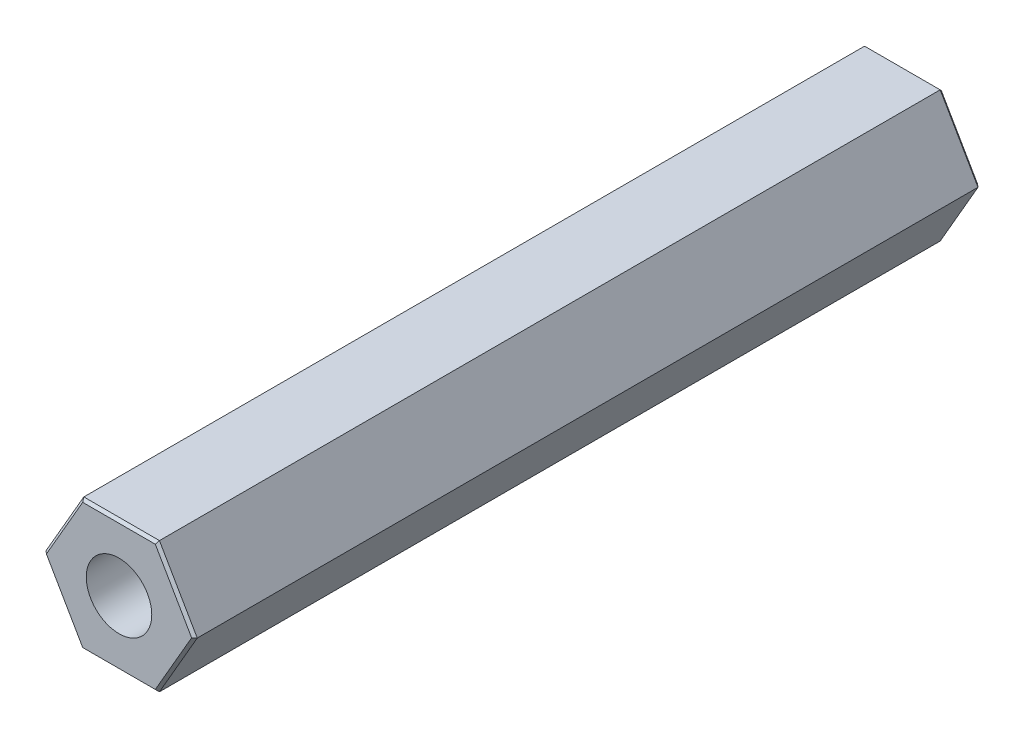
from build123d import *

# Parameters (mm, degrees)
P_IDAT_VYSUNUT_M1_DEPTH  = 30
ZKOSEN_1_SIZE            = 0.1
SKICA2_R                 = 1.25
ODEBRAT_VYSUNUT_M1_DEPTH = 12
ODEBRAT_START            = -12
SKICA3_R                 = 1.25
ODEBRAT_VYSUNUT_M2_DEPTH = 12
ZKOSEN_2_SIZE            = 1.25


with BuildPart() as part:
    # Skica1 → P_idat vysunut_m1 (new body)
    with BuildSketch(Plane.XY):
        Polygon((1.443375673, 2.5), (-1.443375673, 2.5), (-2.886751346, 0), (-1.443375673, -2.5), (1.443375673, -2.5), (2.886751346, 0), align=None)
    extrude(amount=P_IDAT_VYSUNUT_M1_DEPTH)

    # Zkosen_1
    zkosen_1_edges = [part.edges().sort_by_distance(p)[0] for p in [
        (-2.165063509, 1.25, 30),
        (-2.165063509, -1.25, 30),
        (0, -2.5, 30),
        (2.165063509, -1.25, 30),
        (2.165063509, 1.25, 30),
        (2.165063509, -1.25, 0),
        (0, -2.5, 0),
        (-2.165063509, -1.25, 0),
        (0, 2.5, 30),
        (-2.165063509, 1.25, 0),
        (0, 2.5, 0),
        (2.165063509, 1.25, 0),
    ]]
    chamfer(zkosen_1_edges, length=ZKOSEN_1_SIZE)

    # Skica2 → Odebrat vysunut_m1 (cut)
    with BuildSketch(Plane(origin=(0, 0, 0), x_dir=(-1, 0, 0), z_dir=(0, 0, -1))):
        Circle(SKICA2_R)
    extrude(amount=-ODEBRAT_VYSUNUT_M1_DEPTH, mode=Mode.SUBTRACT)

    # Skica3 → Odebrat vysunut_m2 (cut)
    with BuildSketch(Plane.XY.offset(30).offset(ODEBRAT_START)):
        with Locations(Location((0, 0, 0), (0, 0, 180))):
            Circle(SKICA3_R)
    extrude(amount=ODEBRAT_VYSUNUT_M2_DEPTH, mode=Mode.SUBTRACT)

    # Zkosen_2
    zkosen_2_edges = [part.edges().sort_by_distance(p)[0] for p in [
        (1.25, 0, 12),
        (1.25, 0, 18),
    ]]
    chamfer(zkosen_2_edges, length=ZKOSEN_2_SIZE)


solid = part.part
